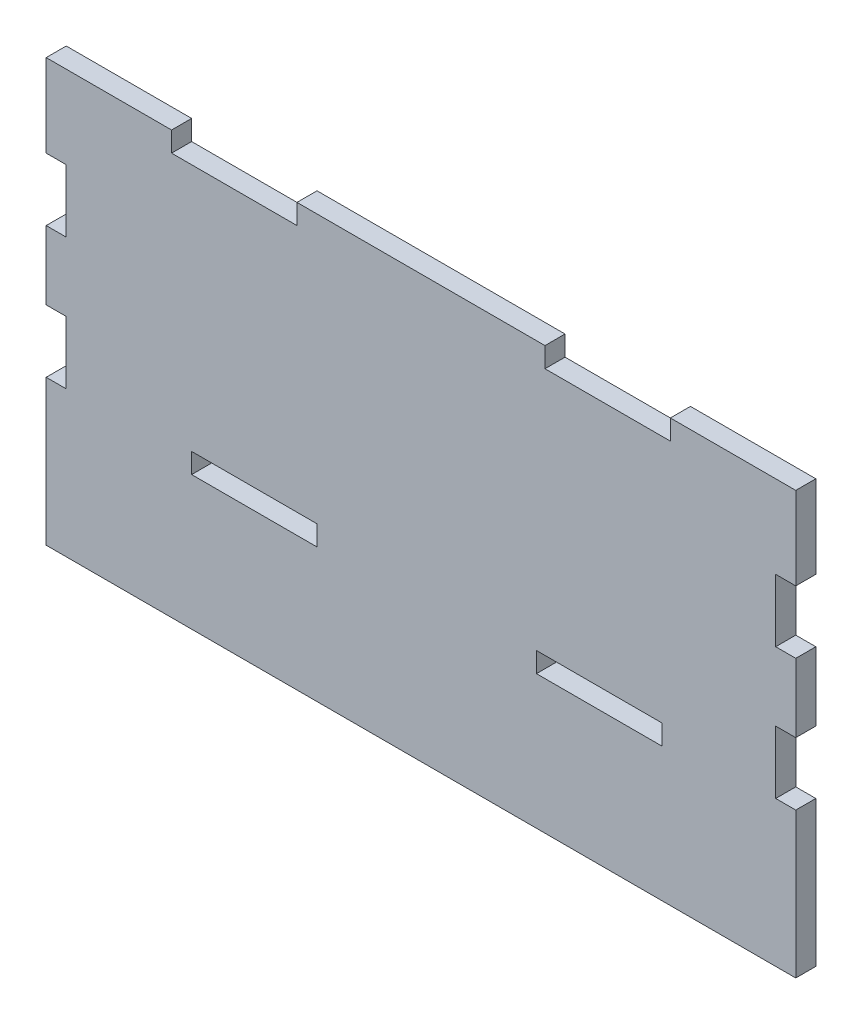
from build123d import *

# Parameters (mm, degrees)
SKETCH1_W           = 100
SKETCH1_H           = 16
BOSS_EXTRUDE1_DEPTH = 16


with BuildPart() as part:
    # Sketch1 → Boss-Extrude1 (new body)
    with BuildSketch(Plane.XY):
        Polygon((84, 320.8), (-16, 320.8), (-16, 254.8), (0, 254.8), (0, 204.8), (-16, 204.8), (-16, 150), (0, 150), (0, 100), (-16, 100), (-16, -16), (581.8, -16), (581.8, 100), (565.8, 100), (565.8, 150), (581.8, 150), (581.8, 204.8), (565.8, 204.8), (565.8, 254.8), (581.8, 254.8), (581.8, 320.8), (481.8, 320.8), (481.8, 304.8), (381.8, 304.8), (381.8, 320.8), (184, 320.8), (184, 304.8), (84, 304.8), align=None)
        with Locations((150, 98.8)):
            Rectangle(SKETCH1_W, SKETCH1_H, mode=Mode.SUBTRACT)
        with Locations((425, 98.8)):
            Rectangle(SKETCH1_W, SKETCH1_H, mode=Mode.SUBTRACT)
    extrude(amount=BOSS_EXTRUDE1_DEPTH)


solid = part.part
